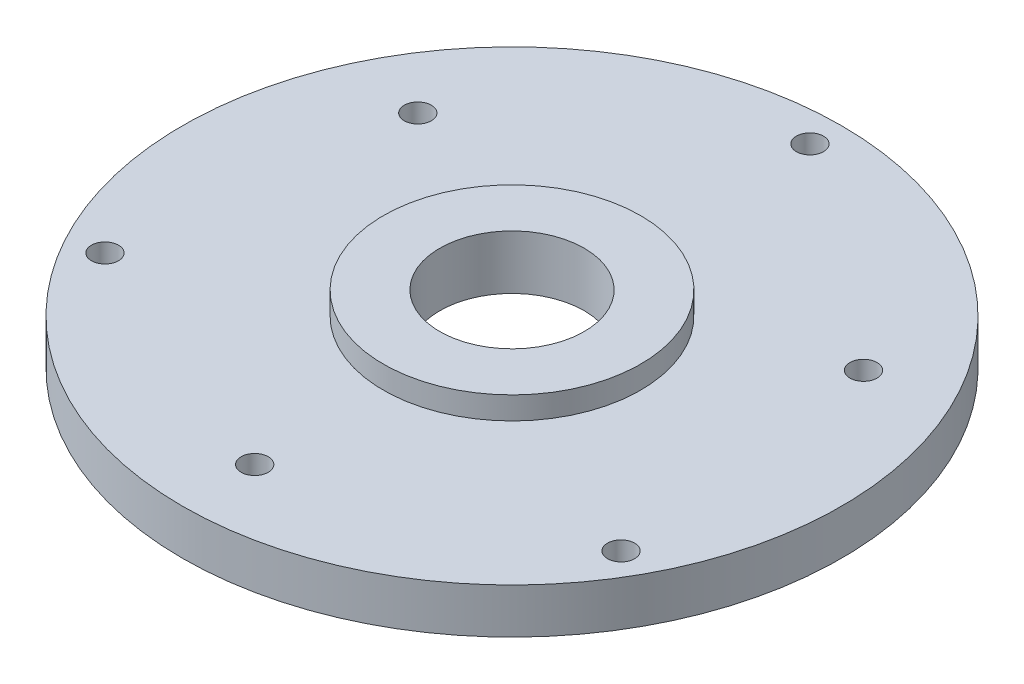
from build123d import *

# Parameters (mm, degrees)
SCHIZZO2_R               = 1.5
TAGLIO_ESTRUSIONE1_DEPTH = 52.860389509
SCHIZZO6_R               = 1.5
TAGLIO_ESTRUSIONE3_DEPTH = 53.160809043


with BuildPart() as part:
    # Schizzo1 → Rivoluzione1 (revolve)
    with BuildSketch(Plane.XY, mode=Mode.PRIVATE) as rivoluzione1_sk:
        Polygon((36.5, 39.385931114), (36.5, 34.385931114), (14, 34.385931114), (14, 35.885931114), (8, 35.885931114), (8, 41.885931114), (14.25, 41.885931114), (14.25, 39.385931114), align=None)
    revolve(rivoluzione1_sk.sketch.rotate(Axis((0, 0, 0), (0, 1, 0)), 90), axis=Axis((0, 0, 0), (0, 1, 0)))

    # Schizzo2 → Taglio-Estrusione1 (cut, through all)
    with BuildSketch(Plane(origin=(0, 39.385931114, 0), x_dir=(1, 0, 0), z_dir=(0, 1, 0))):
        with Locations(Location((0, 33, 0), (0, 0, 270))):
            Circle(SCHIZZO2_R)
        with Locations(Location((28.578838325, -16.5, 0), (0, 0, 270))):
            Circle(SCHIZZO2_R)
        with Locations(Location((-28.578838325, -16.5, 0), (0, 0, 270))):
            Circle(SCHIZZO2_R)
    extrude(amount=-TAGLIO_ESTRUSIONE1_DEPTH, mode=Mode.SUBTRACT)

    # Schizzo6 → Taglio-Estrusione3 (cut, through all)
    with BuildSketch(Plane(origin=(0, 34.385931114, 0), x_dir=(-1, 0, 0), z_dir=(0, -1, 0))):
        with Locations(Location((0, -28.5, 0), (0, 0, 90))):
            Circle(SCHIZZO6_R)
        with Locations(Location((-24.681724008, 14.25, 0), (0, 0, 90))):
            Circle(SCHIZZO6_R)
        with Locations(Location((24.681724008, 14.25, 0), (0, 0, 90))):
            Circle(SCHIZZO6_R)
    extrude(amount=-TAGLIO_ESTRUSIONE3_DEPTH, mode=Mode.SUBTRACT)


solid = part.part
